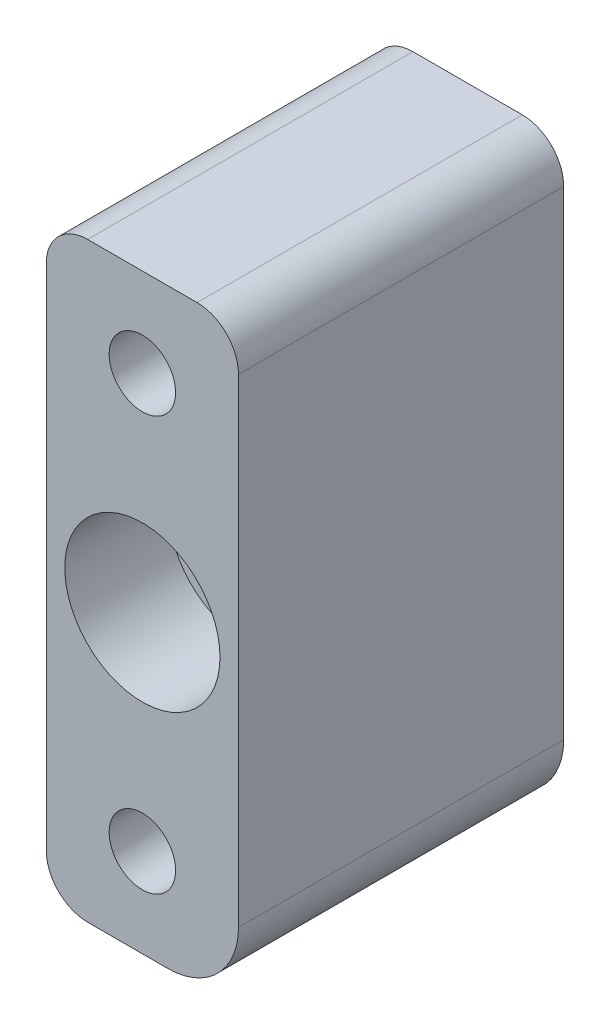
ISO-10303-21;
HEADER;
FILE_DESCRIPTION(('STEP AP214'),'2;1');
FILE_NAME('part.step','',(''),(''),'','','');
FILE_SCHEMA(('AUTOMOTIVE_DESIGN { 1 0 10303 214 1 1 1 1 }'));
ENDSEC;
DATA;
#1=APPLICATION_CONTEXT('core data for automotive mechanical design processes');
#2=APPLICATION_PROTOCOL_DEFINITION('international standard','automotive_design',2000,#1);
#3=PRODUCT_CONTEXT('',#1,'mechanical');
#4=PRODUCT('Part','Part','',(#3));
#5=PRODUCT_RELATED_PRODUCT_CATEGORY('part','',(#4));
#6=PRODUCT_DEFINITION_FORMATION('','',#4);
#7=PRODUCT_DEFINITION_CONTEXT('part definition',#1,'design');
#8=PRODUCT_DEFINITION('design','',#6,#7);
#9=PRODUCT_DEFINITION_SHAPE('','',#8);
#10=(LENGTH_UNIT() NAMED_UNIT(*) SI_UNIT(.MILLI.,.METRE.));
#11=(NAMED_UNIT(*) PLANE_ANGLE_UNIT() SI_UNIT($,.RADIAN.));
#12=(NAMED_UNIT(*) SI_UNIT($,.STERADIAN.) SOLID_ANGLE_UNIT());
#13=UNCERTAINTY_MEASURE_WITH_UNIT(LENGTH_MEASURE(1.E-05),#10,'distance_accuracy_value','');
#14=(GEOMETRIC_REPRESENTATION_CONTEXT(3) GLOBAL_UNCERTAINTY_ASSIGNED_CONTEXT((#13)) GLOBAL_UNIT_ASSIGNED_CONTEXT((#10,
#11,#12)) REPRESENTATION_CONTEXT('',''));
#15=CARTESIAN_POINT('',(0.,0.,0.));
#16=DIRECTION('',(0.,0.,1.));
#17=DIRECTION('',(1.,0.,0.));
#18=AXIS2_PLACEMENT_3D('',#15,#16,#17);
#19=CARTESIAN_POINT('',(-917.384045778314,-55.0804062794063,71.9582));
#20=DIRECTION('',(0.,0.,-1.));
#21=DIRECTION('',(-1.,0.,0.));
#22=AXIS2_PLACEMENT_3D('',#19,#20,#21);
#23=CYLINDRICAL_SURFACE('',#22,7.61999999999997);
#24=CARTESIAN_POINT('',(-917.384045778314,-55.0804062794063,37.0332));
#25=DIRECTION('',(0.,0.,-1.));
#26=DIRECTION('',(-1.,0.,0.));
#27=AXIS2_PLACEMENT_3D('',#24,#25,#26);
#28=CIRCLE('',#27,7.61999999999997);
#29=CARTESIAN_POINT('',(-909.764045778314,-55.0804062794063,37.0332));
#30=VERTEX_POINT('',#29);
#31=CARTESIAN_POINT('',(-917.384045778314,-62.7004062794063,37.0332));
#32=VERTEX_POINT('',#31);
#33=EDGE_CURVE('E104',#30,#32,#28,.T.);
#34=ORIENTED_EDGE('',*,*,#33,.F.);
#35=DIRECTION('',(0.,0.,-1.));
#36=VECTOR('',#35,1.);
#37=CARTESIAN_POINT('',(-909.764045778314,-55.0804062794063,71.9582));
#38=LINE('',#37,#36);
#39=CARTESIAN_POINT('',(-909.764045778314,-55.0804062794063,71.9582));
#40=VERTEX_POINT('',#39);
#41=EDGE_CURVE('E12',#40,#30,#38,.T.);
#42=ORIENTED_EDGE('',*,*,#41,.F.);
#43=CARTESIAN_POINT('',(-917.384045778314,-55.0804062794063,71.9582));
#44=DIRECTION('',(0.,0.,-1.));
#45=DIRECTION('',(-1.,0.,0.));
#46=AXIS2_PLACEMENT_3D('',#43,#44,#45);
#47=CIRCLE('',#46,7.61999999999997);
#48=CARTESIAN_POINT('',(-917.384045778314,-62.7004062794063,71.9582));
#49=VERTEX_POINT('',#48);
#50=EDGE_CURVE('E106',#40,#49,#47,.T.);
#51=ORIENTED_EDGE('',*,*,#50,.T.);
#52=DIRECTION('',(0.,0.,-1.));
#53=VECTOR('',#52,1.);
#54=CARTESIAN_POINT('',(-917.384045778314,-62.7004062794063,71.9582));
#55=LINE('',#54,#53);
#56=EDGE_CURVE('E102',#49,#32,#55,.T.);
#57=ORIENTED_EDGE('',*,*,#56,.T.);
#58=EDGE_LOOP('',(#34,#42,#51,#57));
#59=FACE_BOUND('',#58,.T.);
#60=ADVANCED_FACE('F50',(#59),#23,.T.);
#61=CARTESIAN_POINT('',(-909.764045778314,-3.64540627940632,71.9582));
#62=DIRECTION('',(1.,0.,0.));
#63=DIRECTION('',(0.,0.,-1.));
#64=AXIS2_PLACEMENT_3D('',#61,#62,#63);
#65=PLANE('',#64);
#66=DIRECTION('',(0.,-1.,0.));
#67=VECTOR('',#66,1.);
#68=CARTESIAN_POINT('',(-909.764045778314,-55.0804062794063,37.0332));
#69=LINE('',#68,#67);
#70=CARTESIAN_POINT('',(-909.764045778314,-3.64540627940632,37.0332));
#71=VERTEX_POINT('',#70);
#72=EDGE_CURVE('E119',#71,#30,#69,.T.);
#73=ORIENTED_EDGE('',*,*,#72,.F.);
#74=DIRECTION('',(0.,0.,-1.));
#75=VECTOR('',#74,1.);
#76=CARTESIAN_POINT('',(-909.764045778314,-3.64540627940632,71.9582));
#77=LINE('',#76,#75);
#78=CARTESIAN_POINT('',(-909.764045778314,-3.64540627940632,71.9582));
#79=VERTEX_POINT('',#78);
#80=EDGE_CURVE('E61',#79,#71,#77,.T.);
#81=ORIENTED_EDGE('',*,*,#80,.F.);
#82=DIRECTION('',(0.,-1.,0.));
#83=VECTOR('',#82,1.);
#84=CARTESIAN_POINT('',(-909.764045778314,-3.64540627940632,71.9582));
#85=LINE('',#84,#83);
#86=EDGE_CURVE('E109',#79,#40,#85,.T.);
#87=ORIENTED_EDGE('',*,*,#86,.T.);
#88=ORIENTED_EDGE('',*,*,#41,.T.);
#89=EDGE_LOOP('',(#73,#81,#87,#88));
#90=FACE_BOUND('',#89,.T.);
#91=ADVANCED_FACE('F258',(#90),#65,.T.);
#92=CARTESIAN_POINT('',(-914.209045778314,-3.64540627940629,71.9582));
#93=DIRECTION('',(0.,0.,-1.));
#94=DIRECTION('',(-1.,0.,0.));
#95=AXIS2_PLACEMENT_3D('',#92,#93,#94);
#96=CYLINDRICAL_SURFACE('',#95,4.44500000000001);
#97=CARTESIAN_POINT('',(-914.209045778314,-3.64540627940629,37.0332));
#98=DIRECTION('',(0.,0.,-1.));
#99=DIRECTION('',(-1.,0.,0.));
#100=AXIS2_PLACEMENT_3D('',#97,#98,#99);
#101=CIRCLE('',#100,4.44500000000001);
#102=CARTESIAN_POINT('',(-914.209045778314,0.799593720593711,37.0332));
#103=VERTEX_POINT('',#102);
#104=EDGE_CURVE('E134',#103,#71,#101,.T.);
#105=ORIENTED_EDGE('',*,*,#104,.F.);
#106=DIRECTION('',(0.,0.,-1.));
#107=VECTOR('',#106,1.);
#108=CARTESIAN_POINT('',(-914.209045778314,0.799593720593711,71.9582));
#109=LINE('',#108,#107);
#110=CARTESIAN_POINT('',(-914.209045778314,0.799593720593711,71.9582));
#111=VERTEX_POINT('',#110);
#112=EDGE_CURVE('E187',#111,#103,#109,.T.);
#113=ORIENTED_EDGE('',*,*,#112,.F.);
#114=CARTESIAN_POINT('',(-914.209045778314,-3.64540627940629,71.9582));
#115=DIRECTION('',(0.,0.,-1.));
#116=DIRECTION('',(-1.,0.,0.));
#117=AXIS2_PLACEMENT_3D('',#114,#115,#116);
#118=CIRCLE('',#117,4.44500000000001);
#119=EDGE_CURVE('E195',#111,#79,#118,.T.);
#120=ORIENTED_EDGE('',*,*,#119,.T.);
#121=ORIENTED_EDGE('',*,*,#80,.T.);
#122=EDGE_LOOP('',(#105,#113,#120,#121));
#123=FACE_BOUND('',#122,.T.);
#124=ADVANCED_FACE('F194',(#123),#96,.T.);
#125=CARTESIAN_POINT('',(-914.209045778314,0.799593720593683,71.9582));
#126=DIRECTION('',(0.,1.,0.));
#127=DIRECTION('',(0.,0.,1.));
#128=AXIS2_PLACEMENT_3D('',#125,#126,#127);
#129=PLANE('',#128);
#130=DIRECTION('',(1.,0.,0.));
#131=VECTOR('',#130,1.);
#132=CARTESIAN_POINT('',(-917.384045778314,0.799593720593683,37.0332));
#133=LINE('',#132,#131);
#134=CARTESIAN_POINT('',(-925.956545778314,0.799593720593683,37.0332));
#135=VERTEX_POINT('',#134);
#136=EDGE_CURVE('E137',#135,#103,#133,.T.);
#137=ORIENTED_EDGE('',*,*,#136,.F.);
#138=DIRECTION('',(0.,0.,-1.));
#139=VECTOR('',#138,1.);
#140=CARTESIAN_POINT('',(-925.956545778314,0.799593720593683,71.9582));
#141=LINE('',#140,#139);
#142=CARTESIAN_POINT('',(-925.956545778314,0.799593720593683,71.9582));
#143=VERTEX_POINT('',#142);
#144=EDGE_CURVE('E175',#143,#135,#141,.T.);
#145=ORIENTED_EDGE('',*,*,#144,.F.);
#146=DIRECTION('',(1.,0.,0.));
#147=VECTOR('',#146,1.);
#148=CARTESIAN_POINT('',(-914.209045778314,0.799593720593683,71.9582));
#149=LINE('',#148,#147);
#150=EDGE_CURVE('E188',#143,#111,#149,.T.);
#151=ORIENTED_EDGE('',*,*,#150,.T.);
#152=ORIENTED_EDGE('',*,*,#112,.T.);
#153=EDGE_LOOP('',(#137,#145,#151,#152));
#154=FACE_BOUND('',#153,.T.);
#155=ADVANCED_FACE('F182',(#154),#129,.T.);
#156=CARTESIAN_POINT('',(-925.956545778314,-3.64540627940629,71.9582));
#157=DIRECTION('',(0.,0.,-1.));
#158=DIRECTION('',(-1.,0.,0.));
#159=AXIS2_PLACEMENT_3D('',#156,#157,#158);
#160=CYLINDRICAL_SURFACE('',#159,4.44500000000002);
#161=CARTESIAN_POINT('',(-925.956545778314,-3.64540627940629,37.0332));
#162=DIRECTION('',(0.,0.,-1.));
#163=DIRECTION('',(-1.,0.,0.));
#164=AXIS2_PLACEMENT_3D('',#161,#162,#163);
#165=CIRCLE('',#164,4.44500000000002);
#166=CARTESIAN_POINT('',(-930.401545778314,-3.64540627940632,37.0332));
#167=VERTEX_POINT('',#166);
#168=EDGE_CURVE('E141',#167,#135,#165,.T.);
#169=ORIENTED_EDGE('',*,*,#168,.F.);
#170=DIRECTION('',(0.,0.,-1.));
#171=VECTOR('',#170,1.);
#172=CARTESIAN_POINT('',(-930.401545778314,-3.64540627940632,71.9582));
#173=LINE('',#172,#171);
#174=CARTESIAN_POINT('',(-930.401545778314,-3.64540627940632,71.9582));
#175=VERTEX_POINT('',#174);
#176=EDGE_CURVE('E164',#175,#167,#173,.T.);
#177=ORIENTED_EDGE('',*,*,#176,.F.);
#178=CARTESIAN_POINT('',(-925.956545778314,-3.64540627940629,71.9582));
#179=DIRECTION('',(0.,0.,-1.));
#180=DIRECTION('',(1.,0.,0.));
#181=AXIS2_PLACEMENT_3D('',#178,#179,#180);
#182=CIRCLE('',#181,4.44500000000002);
#183=EDGE_CURVE('E250',#175,#143,#182,.T.);
#184=ORIENTED_EDGE('',*,*,#183,.T.);
#185=ORIENTED_EDGE('',*,*,#144,.T.);
#186=EDGE_LOOP('',(#169,#177,#184,#185));
#187=FACE_BOUND('',#186,.T.);
#188=ADVANCED_FACE('F177',(#187),#160,.T.);
#189=CARTESIAN_POINT('',(-930.401545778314,-3.64540627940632,71.9582));
#190=DIRECTION('',(-1.,0.,0.));
#191=DIRECTION('',(0.,0.,1.));
#192=AXIS2_PLACEMENT_3D('',#189,#190,#191);
#193=PLANE('',#192);
#194=DIRECTION('',(0.,1.,0.));
#195=VECTOR('',#194,1.);
#196=CARTESIAN_POINT('',(-930.401545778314,-55.0804062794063,37.0332));
#197=LINE('',#196,#195);
#198=CARTESIAN_POINT('',(-930.401545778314,-58.2554062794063,37.0332));
#199=VERTEX_POINT('',#198);
#200=EDGE_CURVE('E145',#199,#167,#197,.T.);
#201=ORIENTED_EDGE('',*,*,#200,.F.);
#202=DIRECTION('',(0.,0.,-1.));
#203=VECTOR('',#202,1.);
#204=CARTESIAN_POINT('',(-930.401545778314,-58.2554062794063,71.9582));
#205=LINE('',#204,#203);
#206=CARTESIAN_POINT('',(-930.401545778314,-58.2554062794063,71.9582));
#207=VERTEX_POINT('',#206);
#208=EDGE_CURVE('E157',#207,#199,#205,.T.);
#209=ORIENTED_EDGE('',*,*,#208,.F.);
#210=DIRECTION('',(0.,1.,0.));
#211=VECTOR('',#210,1.);
#212=CARTESIAN_POINT('',(-930.401545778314,-3.64540627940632,71.9582));
#213=LINE('',#212,#211);
#214=EDGE_CURVE('E170',#207,#175,#213,.T.);
#215=ORIENTED_EDGE('',*,*,#214,.T.);
#216=ORIENTED_EDGE('',*,*,#176,.T.);
#217=EDGE_LOOP('',(#201,#209,#215,#216));
#218=FACE_BOUND('',#217,.T.);
#219=ADVANCED_FACE('F166',(#218),#193,.T.);
#220=CARTESIAN_POINT('',(-925.956545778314,-58.2554062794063,71.9582));
#221=DIRECTION('',(0.,0.,-1.));
#222=DIRECTION('',(-1.,0.,0.));
#223=AXIS2_PLACEMENT_3D('',#220,#221,#222);
#224=CYLINDRICAL_SURFACE('',#223,4.44500000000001);
#225=CARTESIAN_POINT('',(-925.956545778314,-58.2554062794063,37.0332));
#226=DIRECTION('',(0.,0.,-1.));
#227=DIRECTION('',(-1.,0.,0.));
#228=AXIS2_PLACEMENT_3D('',#225,#226,#227);
#229=CIRCLE('',#228,4.44500000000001);
#230=CARTESIAN_POINT('',(-925.956545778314,-62.7004062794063,37.0332));
#231=VERTEX_POINT('',#230);
#232=EDGE_CURVE('E116',#231,#199,#229,.T.);
#233=ORIENTED_EDGE('',*,*,#232,.F.);
#234=DIRECTION('',(0.,0.,-1.));
#235=VECTOR('',#234,1.);
#236=CARTESIAN_POINT('',(-925.956545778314,-62.7004062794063,71.9582));
#237=LINE('',#236,#235);
#238=CARTESIAN_POINT('',(-925.956545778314,-62.7004062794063,71.9582));
#239=VERTEX_POINT('',#238);
#240=EDGE_CURVE('E98',#239,#231,#237,.T.);
#241=ORIENTED_EDGE('',*,*,#240,.F.);
#242=CARTESIAN_POINT('',(-925.956545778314,-58.2554062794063,71.9582));
#243=DIRECTION('',(0.,0.,-1.));
#244=DIRECTION('',(-1.,0.,0.));
#245=AXIS2_PLACEMENT_3D('',#242,#243,#244);
#246=CIRCLE('',#245,4.44500000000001);
#247=EDGE_CURVE('E159',#239,#207,#246,.T.);
#248=ORIENTED_EDGE('',*,*,#247,.T.);
#249=ORIENTED_EDGE('',*,*,#208,.T.);
#250=EDGE_LOOP('',(#233,#241,#248,#249));
#251=FACE_BOUND('',#250,.T.);
#252=ADVANCED_FACE('F152',(#251),#224,.T.);
#253=CARTESIAN_POINT('',(-917.384045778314,-62.7004062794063,71.9582));
#254=DIRECTION('',(0.,-1.,0.));
#255=DIRECTION('',(1.,0.,0.));
#256=AXIS2_PLACEMENT_3D('',#253,#254,#255);
#257=PLANE('',#256);
#258=DIRECTION('',(-1.,0.,0.));
#259=VECTOR('',#258,1.);
#260=CARTESIAN_POINT('',(-917.384045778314,-62.7004062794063,37.0332));
#261=LINE('',#260,#259);
#262=EDGE_CURVE('E54',#32,#231,#261,.T.);
#263=ORIENTED_EDGE('',*,*,#262,.F.);
#264=ORIENTED_EDGE('',*,*,#56,.F.);
#265=DIRECTION('',(-1.,0.,0.));
#266=VECTOR('',#265,1.);
#267=CARTESIAN_POINT('',(-917.384045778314,-62.7004062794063,71.9582));
#268=LINE('',#267,#266);
#269=EDGE_CURVE('E243',#49,#239,#268,.T.);
#270=ORIENTED_EDGE('',*,*,#269,.T.);
#271=ORIENTED_EDGE('',*,*,#240,.T.);
#272=EDGE_LOOP('',(#263,#264,#270,#271));
#273=FACE_BOUND('',#272,.T.);
#274=ADVANCED_FACE('F112',(#273),#257,.T.);
#275=CARTESIAN_POINT('',(-917.384045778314,-55.0804062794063,71.9582));
#276=DIRECTION('',(0.,0.,-1.));
#277=DIRECTION('',(-1.,0.,0.));
#278=AXIS2_PLACEMENT_3D('',#275,#276,#277);
#279=PLANE('',#278);
#280=CARTESIAN_POINT('',(-920.082795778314,-8.72540627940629,71.9582));
#281=DIRECTION('',(0.,0.,-1.));
#282=DIRECTION('',(-1.,0.,0.));
#283=AXIS2_PLACEMENT_3D('',#280,#281,#282);
#284=CIRCLE('',#283,3.56869999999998);
#285=CARTESIAN_POINT('',(-923.651495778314,-8.72540627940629,71.9582));
#286=VERTEX_POINT('',#285);
#287=EDGE_CURVE('E422',#286,#286,#284,.T.);
#288=ORIENTED_EDGE('',*,*,#287,.T.);
#289=EDGE_LOOP('',(#288));
#290=FACE_BOUND('',#289,.T.);
#291=CARTESIAN_POINT('',(-920.082795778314,-53.1754062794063,71.9582));
#292=DIRECTION('',(0.,0.,-1.));
#293=DIRECTION('',(-1.,0.,0.));
#294=AXIS2_PLACEMENT_3D('',#291,#292,#293);
#295=CIRCLE('',#294,3.56869999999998);
#296=CARTESIAN_POINT('',(-923.651495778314,-53.1754062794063,71.9582));
#297=VERTEX_POINT('',#296);
#298=EDGE_CURVE('E211',#297,#297,#295,.T.);
#299=ORIENTED_EDGE('',*,*,#298,.T.);
#300=EDGE_LOOP('',(#299));
#301=FACE_BOUND('',#300,.T.);
#302=CARTESIAN_POINT('',(-920.082795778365,-30.9504062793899,71.9582));
#303=DIRECTION('',(0.,0.,1.));
#304=DIRECTION('',(1.,0.,0.));
#305=AXIS2_PLACEMENT_3D('',#302,#303,#304);
#306=CIRCLE('',#305,8.334375);
#307=CARTESIAN_POINT('',(-911.748420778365,-30.9504062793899,71.9582));
#308=VERTEX_POINT('',#307);
#309=EDGE_CURVE('E121',#308,#308,#306,.T.);
#310=ORIENTED_EDGE('',*,*,#309,.F.);
#311=EDGE_LOOP('',(#310));
#312=FACE_BOUND('',#311,.T.);
#313=ORIENTED_EDGE('',*,*,#50,.F.);
#314=ORIENTED_EDGE('',*,*,#86,.F.);
#315=ORIENTED_EDGE('',*,*,#119,.F.);
#316=ORIENTED_EDGE('',*,*,#150,.F.);
#317=ORIENTED_EDGE('',*,*,#183,.F.);
#318=ORIENTED_EDGE('',*,*,#214,.F.);
#319=ORIENTED_EDGE('',*,*,#247,.F.);
#320=ORIENTED_EDGE('',*,*,#269,.F.);
#321=EDGE_LOOP('',(#313,#314,#315,#316,#317,#318,#319,#320));
#322=FACE_BOUND('',#321,.T.);
#323=ADVANCED_FACE('F260',(#290,#301,#312,#322),#279,.F.);
#324=CARTESIAN_POINT('',(-917.384045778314,-55.0804062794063,37.0332));
#325=DIRECTION('',(0.,0.,-1.));
#326=DIRECTION('',(-1.,0.,0.));
#327=AXIS2_PLACEMENT_3D('',#324,#325,#326);
#328=PLANE('',#327);
#329=CARTESIAN_POINT('',(-920.082795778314,-8.72540627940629,37.0332));
#330=DIRECTION('',(0.,0.,-1.));
#331=DIRECTION('',(-1.,0.,0.));
#332=AXIS2_PLACEMENT_3D('',#329,#330,#331);
#333=CIRCLE('',#332,5.35940000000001);
#334=CARTESIAN_POINT('',(-925.442195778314,-8.72540627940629,37.0332));
#335=VERTEX_POINT('',#334);
#336=EDGE_CURVE('E208',#335,#335,#333,.T.);
#337=ORIENTED_EDGE('',*,*,#336,.F.);
#338=EDGE_LOOP('',(#337));
#339=FACE_BOUND('',#338,.T.);
#340=CARTESIAN_POINT('',(-920.082795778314,-53.1754062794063,37.0332));
#341=DIRECTION('',(0.,0.,-1.));
#342=DIRECTION('',(-1.,0.,0.));
#343=AXIS2_PLACEMENT_3D('',#340,#341,#342);
#344=CIRCLE('',#343,5.35940000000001);
#345=CARTESIAN_POINT('',(-925.442195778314,-53.1754062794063,37.0332));
#346=VERTEX_POINT('',#345);
#347=EDGE_CURVE('E213',#346,#346,#344,.T.);
#348=ORIENTED_EDGE('',*,*,#347,.F.);
#349=EDGE_LOOP('',(#348));
#350=FACE_BOUND('',#349,.T.);
#351=CARTESIAN_POINT('',(-920.082795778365,-30.9504062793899,37.0332));
#352=DIRECTION('',(0.,0.,-1.));
#353=DIRECTION('',(-1.,0.,0.));
#354=AXIS2_PLACEMENT_3D('',#351,#352,#353);
#355=CIRCLE('',#354,6.34999999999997);
#356=CARTESIAN_POINT('',(-926.432795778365,-30.9504062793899,37.0332));
#357=VERTEX_POINT('',#356);
#358=EDGE_CURVE('E130',#357,#357,#355,.F.);
#359=ORIENTED_EDGE('',*,*,#358,.T.);
#360=EDGE_LOOP('',(#359));
#361=FACE_BOUND('',#360,.T.);
#362=ORIENTED_EDGE('',*,*,#33,.T.);
#363=ORIENTED_EDGE('',*,*,#262,.T.);
#364=ORIENTED_EDGE('',*,*,#232,.T.);
#365=ORIENTED_EDGE('',*,*,#200,.T.);
#366=ORIENTED_EDGE('',*,*,#168,.T.);
#367=ORIENTED_EDGE('',*,*,#136,.T.);
#368=ORIENTED_EDGE('',*,*,#104,.T.);
#369=ORIENTED_EDGE('',*,*,#72,.T.);
#370=EDGE_LOOP('',(#362,#363,#364,#365,#366,#367,#368,#369));
#371=FACE_BOUND('',#370,.T.);
#372=ADVANCED_FACE('F52',(#339,#350,#361,#371),#328,.T.);
#373=CARTESIAN_POINT('',(-920.082795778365,-30.9504062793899,71.9582));
#374=DIRECTION('',(0.,0.,1.));
#375=DIRECTION('',(1.,0.,0.));
#376=AXIS2_PLACEMENT_3D('',#373,#374,#375);
#377=CYLINDRICAL_SURFACE('',#376,8.334375);
#378=CARTESIAN_POINT('',(-920.082795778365,-30.9504062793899,60.833));
#379=DIRECTION('',(0.,0.,1.));
#380=DIRECTION('',(1.,0.,0.));
#381=AXIS2_PLACEMENT_3D('',#378,#379,#380);
#382=CIRCLE('',#381,8.334375);
#383=CARTESIAN_POINT('',(-911.748420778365,-30.9504062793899,60.833));
#384=VERTEX_POINT('',#383);
#385=EDGE_CURVE('E126',#384,#384,#382,.T.);
#386=ORIENTED_EDGE('',*,*,#385,.F.);
#387=EDGE_LOOP('',(#386));
#388=FACE_BOUND('',#387,.T.);
#389=ORIENTED_EDGE('',*,*,#309,.T.);
#390=EDGE_LOOP('',(#389));
#391=FACE_BOUND('',#390,.T.);
#392=ADVANCED_FACE('F274',(#388,#391),#377,.F.);
#393=CARTESIAN_POINT('',(-913.732795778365,-30.9504062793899,60.833));
#394=DIRECTION('',(0.,0.,-1.));
#395=DIRECTION('',(-1.,0.,0.));
#396=AXIS2_PLACEMENT_3D('',#393,#394,#395);
#397=PLANE('',#396);
#398=CARTESIAN_POINT('',(-920.082795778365,-30.9504062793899,60.833));
#399=DIRECTION('',(0.,0.,1.));
#400=DIRECTION('',(1.,0.,0.));
#401=AXIS2_PLACEMENT_3D('',#398,#399,#400);
#402=CIRCLE('',#401,6.34999999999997);
#403=CARTESIAN_POINT('',(-913.732795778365,-30.9504062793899,60.833));
#404=VERTEX_POINT('',#403);
#405=EDGE_CURVE('E223',#404,#404,#402,.T.);
#406=ORIENTED_EDGE('',*,*,#405,.F.);
#407=EDGE_LOOP('',(#406));
#408=FACE_BOUND('',#407,.T.);
#409=ORIENTED_EDGE('',*,*,#385,.T.);
#410=EDGE_LOOP('',(#409));
#411=FACE_BOUND('',#410,.T.);
#412=ADVANCED_FACE('F333',(#408,#411),#397,.F.);
#413=CARTESIAN_POINT('',(-920.082795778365,-30.9504062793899,71.9582));
#414=DIRECTION('',(0.,0.,1.));
#415=DIRECTION('',(1.,0.,0.));
#416=AXIS2_PLACEMENT_3D('',#413,#414,#415);
#417=CYLINDRICAL_SURFACE('',#416,6.34999999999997);
#418=ORIENTED_EDGE('',*,*,#358,.F.);
#419=EDGE_LOOP('',(#418));
#420=FACE_BOUND('',#419,.T.);
#421=ORIENTED_EDGE('',*,*,#405,.T.);
#422=EDGE_LOOP('',(#421));
#423=FACE_BOUND('',#422,.T.);
#424=ADVANCED_FACE('F341',(#420,#423),#417,.F.);
#425=CARTESIAN_POINT('',(-920.082795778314,-53.1754062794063,40.2082));
#426=DIRECTION('',(0.,0.,-1.));
#427=DIRECTION('',(-1.,0.,0.));
#428=AXIS2_PLACEMENT_3D('',#425,#426,#427);
#429=CYLINDRICAL_SURFACE('',#428,5.35940000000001);
#430=CARTESIAN_POINT('',(-920.082795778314,-53.1754062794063,49.8602));
#431=DIRECTION('',(0.,0.,-1.));
#432=DIRECTION('',(-1.,0.,0.));
#433=AXIS2_PLACEMENT_3D('',#430,#431,#432);
#434=CIRCLE('',#433,5.35940000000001);
#435=CARTESIAN_POINT('',(-925.442195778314,-53.1754062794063,49.8602));
#436=VERTEX_POINT('',#435);
#437=EDGE_CURVE('E216',#436,#436,#434,.T.);
#438=ORIENTED_EDGE('',*,*,#437,.F.);
#439=EDGE_LOOP('',(#438));
#440=FACE_BOUND('',#439,.T.);
#441=ORIENTED_EDGE('',*,*,#347,.T.);
#442=EDGE_LOOP('',(#441));
#443=FACE_BOUND('',#442,.T.);
#444=ADVANCED_FACE('F350',(#440,#443),#429,.F.);
#445=CARTESIAN_POINT('',(-916.514095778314,-53.1754062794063,49.8602));
#446=DIRECTION('',(0.,0.,1.));
#447=DIRECTION('',(1.,0.,0.));
#448=AXIS2_PLACEMENT_3D('',#445,#446,#447);
#449=PLANE('',#448);
#450=CARTESIAN_POINT('',(-920.082795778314,-53.1754062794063,49.8602));
#451=DIRECTION('',(0.,0.,-1.));
#452=DIRECTION('',(-1.,0.,0.));
#453=AXIS2_PLACEMENT_3D('',#450,#451,#452);
#454=CIRCLE('',#453,3.56869999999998);
#455=CARTESIAN_POINT('',(-923.651495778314,-53.1754062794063,49.8602));
#456=VERTEX_POINT('',#455);
#457=EDGE_CURVE('E225',#456,#456,#454,.T.);
#458=ORIENTED_EDGE('',*,*,#457,.F.);
#459=EDGE_LOOP('',(#458));
#460=FACE_BOUND('',#459,.T.);
#461=ORIENTED_EDGE('',*,*,#437,.T.);
#462=EDGE_LOOP('',(#461));
#463=FACE_BOUND('',#462,.T.);
#464=ADVANCED_FACE('F360',(#460,#463),#449,.F.);
#465=CARTESIAN_POINT('',(-920.082795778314,-53.1754062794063,40.2082));
#466=DIRECTION('',(0.,0.,-1.));
#467=DIRECTION('',(-1.,0.,0.));
#468=AXIS2_PLACEMENT_3D('',#465,#466,#467);
#469=CYLINDRICAL_SURFACE('',#468,3.56869999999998);
#470=ORIENTED_EDGE('',*,*,#298,.F.);
#471=EDGE_LOOP('',(#470));
#472=FACE_BOUND('',#471,.T.);
#473=ORIENTED_EDGE('',*,*,#457,.T.);
#474=EDGE_LOOP('',(#473));
#475=FACE_BOUND('',#474,.T.);
#476=ADVANCED_FACE('F369',(#472,#475),#469,.F.);
#477=CARTESIAN_POINT('',(-920.082795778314,-8.72540627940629,40.2082));
#478=DIRECTION('',(0.,0.,-1.));
#479=DIRECTION('',(-1.,0.,0.));
#480=AXIS2_PLACEMENT_3D('',#477,#478,#479);
#481=CYLINDRICAL_SURFACE('',#480,5.35940000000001);
#482=CARTESIAN_POINT('',(-920.082795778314,-8.72540627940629,49.8602));
#483=DIRECTION('',(0.,0.,-1.));
#484=DIRECTION('',(-1.,0.,0.));
#485=AXIS2_PLACEMENT_3D('',#482,#483,#484);
#486=CIRCLE('',#485,5.35940000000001);
#487=CARTESIAN_POINT('',(-925.442195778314,-8.72540627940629,49.8602));
#488=VERTEX_POINT('',#487);
#489=EDGE_CURVE('E212',#488,#488,#486,.T.);
#490=ORIENTED_EDGE('',*,*,#489,.F.);
#491=EDGE_LOOP('',(#490));
#492=FACE_BOUND('',#491,.T.);
#493=ORIENTED_EDGE('',*,*,#336,.T.);
#494=EDGE_LOOP('',(#493));
#495=FACE_BOUND('',#494,.T.);
#496=ADVANCED_FACE('F378',(#492,#495),#481,.F.);
#497=CARTESIAN_POINT('',(-916.514095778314,-8.72540627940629,49.8602));
#498=DIRECTION('',(0.,0.,1.));
#499=DIRECTION('',(1.,0.,0.));
#500=AXIS2_PLACEMENT_3D('',#497,#498,#499);
#501=PLANE('',#500);
#502=CARTESIAN_POINT('',(-920.082795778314,-8.72540627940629,49.8602));
#503=DIRECTION('',(0.,0.,-1.));
#504=DIRECTION('',(-1.,0.,0.));
#505=AXIS2_PLACEMENT_3D('',#502,#503,#504);
#506=CIRCLE('',#505,3.56869999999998);
#507=CARTESIAN_POINT('',(-923.651495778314,-8.72540627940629,49.8602));
#508=VERTEX_POINT('',#507);
#509=EDGE_CURVE('E425',#508,#508,#506,.T.);
#510=ORIENTED_EDGE('',*,*,#509,.F.);
#511=EDGE_LOOP('',(#510));
#512=FACE_BOUND('',#511,.T.);
#513=ORIENTED_EDGE('',*,*,#489,.T.);
#514=EDGE_LOOP('',(#513));
#515=FACE_BOUND('',#514,.T.);
#516=ADVANCED_FACE('F387',(#512,#515),#501,.F.);
#517=CARTESIAN_POINT('',(-920.082795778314,-8.72540627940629,40.2082));
#518=DIRECTION('',(0.,0.,-1.));
#519=DIRECTION('',(-1.,0.,0.));
#520=AXIS2_PLACEMENT_3D('',#517,#518,#519);
#521=CYLINDRICAL_SURFACE('',#520,3.56869999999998);
#522=ORIENTED_EDGE('',*,*,#287,.F.);
#523=EDGE_LOOP('',(#522));
#524=FACE_BOUND('',#523,.T.);
#525=ORIENTED_EDGE('',*,*,#509,.T.);
#526=EDGE_LOOP('',(#525));
#527=FACE_BOUND('',#526,.T.);
#528=ADVANCED_FACE('F396',(#524,#527),#521,.F.);
#529=CLOSED_SHELL('',(#60,#91,#124,#155,#188,#219,#252,#274,#323,#372,#392,#412,#424,#444,#464,
#476,#496,#516,#528));
#530=MANIFOLD_SOLID_BREP('B2',#529);
#531=ADVANCED_BREP_SHAPE_REPRESENTATION('',(#18,#530),#14);
#532=SHAPE_DEFINITION_REPRESENTATION(#9,#531);
ENDSEC;
END-ISO-10303-21;
